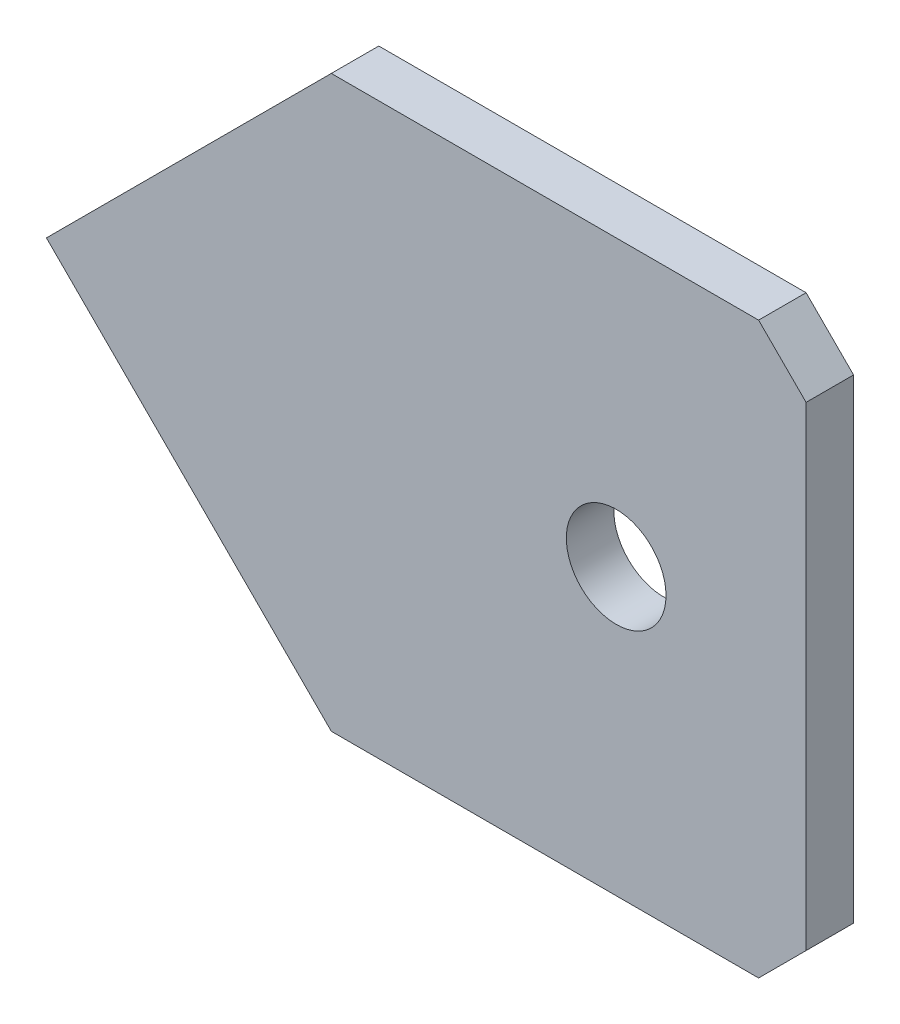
ISO-10303-21;
HEADER;
FILE_DESCRIPTION(('STEP AP214'),'2;1');
FILE_NAME('part.step','',(''),(''),'','','');
FILE_SCHEMA(('AUTOMOTIVE_DESIGN { 1 0 10303 214 1 1 1 1 }'));
ENDSEC;
DATA;
#1=APPLICATION_CONTEXT('core data for automotive mechanical design processes');
#2=APPLICATION_PROTOCOL_DEFINITION('international standard','automotive_design',2000,#1);
#3=PRODUCT_CONTEXT('',#1,'mechanical');
#4=PRODUCT('Part','Part','',(#3));
#5=PRODUCT_RELATED_PRODUCT_CATEGORY('part','',(#4));
#6=PRODUCT_DEFINITION_FORMATION('','',#4);
#7=PRODUCT_DEFINITION_CONTEXT('part definition',#1,'design');
#8=PRODUCT_DEFINITION('design','',#6,#7);
#9=PRODUCT_DEFINITION_SHAPE('','',#8);
#10=(LENGTH_UNIT() NAMED_UNIT(*) SI_UNIT(.MILLI.,.METRE.));
#11=(NAMED_UNIT(*) PLANE_ANGLE_UNIT() SI_UNIT($,.RADIAN.));
#12=(NAMED_UNIT(*) SI_UNIT($,.STERADIAN.) SOLID_ANGLE_UNIT());
#13=UNCERTAINTY_MEASURE_WITH_UNIT(LENGTH_MEASURE(1.E-05),#10,'distance_accuracy_value','');
#14=(GEOMETRIC_REPRESENTATION_CONTEXT(3) GLOBAL_UNCERTAINTY_ASSIGNED_CONTEXT((#13)) GLOBAL_UNIT_ASSIGNED_CONTEXT((#10,
#11,#12)) REPRESENTATION_CONTEXT('',''));
#15=CARTESIAN_POINT('',(0.,0.,0.));
#16=DIRECTION('',(0.,0.,1.));
#17=DIRECTION('',(1.,0.,0.));
#18=AXIS2_PLACEMENT_3D('',#15,#16,#17);
#19=CARTESIAN_POINT('',(-40.,-30.,5.));
#20=DIRECTION('',(0.,1.,0.));
#21=DIRECTION('',(0.,0.,1.));
#22=AXIS2_PLACEMENT_3D('',#19,#20,#21);
#23=PLANE('',#22);
#24=DIRECTION('',(1.,0.,0.));
#25=VECTOR('',#24,1.);
#26=CARTESIAN_POINT('',(-40.,-30.,0.));
#27=LINE('',#26,#25);
#28=CARTESIAN_POINT('',(-9.99999999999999,-30.,0.));
#29=VERTEX_POINT('',#28);
#30=CARTESIAN_POINT('',(35.,-30.,0.));
#31=VERTEX_POINT('',#30);
#32=EDGE_CURVE('E133',#29,#31,#27,.T.);
#33=ORIENTED_EDGE('',*,*,#32,.T.);
#34=DIRECTION('',(0.,0.,1.));
#35=VECTOR('',#34,1.);
#36=CARTESIAN_POINT('',(35.,-30.,5.));
#37=LINE('',#36,#35);
#38=CARTESIAN_POINT('',(35.,-30.,5.));
#39=VERTEX_POINT('',#38);
#40=EDGE_CURVE('E11',#31,#39,#37,.T.);
#41=ORIENTED_EDGE('',*,*,#40,.T.);
#42=DIRECTION('',(1.,0.,0.));
#43=VECTOR('',#42,1.);
#44=CARTESIAN_POINT('',(-40.,-30.,5.));
#45=LINE('',#44,#43);
#46=CARTESIAN_POINT('',(-9.99999999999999,-30.,5.00000000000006));
#47=VERTEX_POINT('',#46);
#48=EDGE_CURVE('E117',#47,#39,#45,.T.);
#49=ORIENTED_EDGE('',*,*,#48,.F.);
#50=DIRECTION('',(0.,0.,-1.));
#51=VECTOR('',#50,1.);
#52=CARTESIAN_POINT('',(-9.99999999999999,-30.,136.40615246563));
#53=LINE('',#52,#51);
#54=EDGE_CURVE('E101',#47,#29,#53,.T.);
#55=ORIENTED_EDGE('',*,*,#54,.T.);
#56=EDGE_LOOP('',(#33,#41,#49,#55));
#57=FACE_BOUND('',#56,.T.);
#58=ADVANCED_FACE('F43',(#57),#23,.F.);
#59=CARTESIAN_POINT('',(40.,30.,5.));
#60=DIRECTION('',(-1.,0.,0.));
#61=DIRECTION('',(0.,-1.,0.));
#62=AXIS2_PLACEMENT_3D('',#59,#60,#61);
#63=PLANE('',#62);
#64=DIRECTION('',(0.,1.,0.));
#65=VECTOR('',#64,1.);
#66=CARTESIAN_POINT('',(40.,30.,0.));
#67=LINE('',#66,#65);
#68=CARTESIAN_POINT('',(40.,-25.,0.));
#69=VERTEX_POINT('',#68);
#70=CARTESIAN_POINT('',(40.,25.,0.));
#71=VERTEX_POINT('',#70);
#72=EDGE_CURVE('E129',#69,#71,#67,.T.);
#73=ORIENTED_EDGE('',*,*,#72,.T.);
#74=DIRECTION('',(0.,0.,1.));
#75=VECTOR('',#74,1.);
#76=CARTESIAN_POINT('',(40.,25.,5.));
#77=LINE('',#76,#75);
#78=CARTESIAN_POINT('',(40.,25.,5.));
#79=VERTEX_POINT('',#78);
#80=EDGE_CURVE('E61',#71,#79,#77,.T.);
#81=ORIENTED_EDGE('',*,*,#80,.T.);
#82=DIRECTION('',(0.,1.,0.));
#83=VECTOR('',#82,1.);
#84=CARTESIAN_POINT('',(40.,30.,5.));
#85=LINE('',#84,#83);
#86=CARTESIAN_POINT('',(40.,-25.,5.));
#87=VERTEX_POINT('',#86);
#88=EDGE_CURVE('E124',#87,#79,#85,.T.);
#89=ORIENTED_EDGE('',*,*,#88,.F.);
#90=DIRECTION('',(0.,0.,-1.));
#91=VECTOR('',#90,1.);
#92=CARTESIAN_POINT('',(40.,-25.,5.));
#93=LINE('',#92,#91);
#94=EDGE_CURVE('E155',#87,#69,#93,.T.);
#95=ORIENTED_EDGE('',*,*,#94,.T.);
#96=EDGE_LOOP('',(#73,#81,#89,#95));
#97=FACE_BOUND('',#96,.T.);
#98=ADVANCED_FACE('F167',(#97),#63,.F.);
#99=CARTESIAN_POINT('',(-40.,30.,5.));
#100=DIRECTION('',(0.,-1.,0.));
#101=DIRECTION('',(0.,0.,-1.));
#102=AXIS2_PLACEMENT_3D('',#99,#100,#101);
#103=PLANE('',#102);
#104=DIRECTION('',(-1.,0.,0.));
#105=VECTOR('',#104,1.);
#106=CARTESIAN_POINT('',(-40.,30.,5.));
#107=LINE('',#106,#105);
#108=CARTESIAN_POINT('',(35.,30.,5.));
#109=VERTEX_POINT('',#108);
#110=CARTESIAN_POINT('',(-10.,30.,5.00000000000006));
#111=VERTEX_POINT('',#110);
#112=EDGE_CURVE('E127',#109,#111,#107,.T.);
#113=ORIENTED_EDGE('',*,*,#112,.F.);
#114=DIRECTION('',(0.,0.,-1.));
#115=VECTOR('',#114,1.);
#116=CARTESIAN_POINT('',(35.,30.,5.));
#117=LINE('',#116,#115);
#118=CARTESIAN_POINT('',(35.,30.,0.));
#119=VERTEX_POINT('',#118);
#120=EDGE_CURVE('E143',#109,#119,#117,.T.);
#121=ORIENTED_EDGE('',*,*,#120,.T.);
#122=DIRECTION('',(-1.,0.,0.));
#123=VECTOR('',#122,1.);
#124=CARTESIAN_POINT('',(-40.,30.,0.));
#125=LINE('',#124,#123);
#126=CARTESIAN_POINT('',(-10.,30.,0.));
#127=VERTEX_POINT('',#126);
#128=EDGE_CURVE('E121',#119,#127,#125,.T.);
#129=ORIENTED_EDGE('',*,*,#128,.T.);
#130=DIRECTION('',(0.,0.,-1.));
#131=VECTOR('',#130,1.);
#132=CARTESIAN_POINT('',(-10.,30.,136.40615246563));
#133=LINE('',#132,#131);
#134=EDGE_CURVE('E111',#111,#127,#133,.T.);
#135=ORIENTED_EDGE('',*,*,#134,.F.);
#136=EDGE_LOOP('',(#113,#121,#129,#135));
#137=FACE_BOUND('',#136,.T.);
#138=ADVANCED_FACE('F161',(#137),#103,.F.);
#139=CARTESIAN_POINT('',(-40.,-30.,5.));
#140=DIRECTION('',(0.,0.,1.));
#141=DIRECTION('',(1.,0.,0.));
#142=AXIS2_PLACEMENT_3D('',#139,#140,#141);
#143=PLANE('',#142);
#144=ORIENTED_EDGE('',*,*,#88,.T.);
#145=DIRECTION('',(0.707106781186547,-0.707106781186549,0.));
#146=VECTOR('',#145,1.);
#147=CARTESIAN_POINT('',(27.5000000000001,37.4999999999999,5.));
#148=LINE('',#147,#146);
#149=EDGE_CURVE('E51',#79,#109,#148,.F.);
#150=ORIENTED_EDGE('',*,*,#149,.T.);
#151=ORIENTED_EDGE('',*,*,#112,.T.);
#152=DIRECTION('',(0.707106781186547,0.707106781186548,0.));
#153=VECTOR('',#152,1.);
#154=CARTESIAN_POINT('',(-55.,-15.,5.));
#155=LINE('',#154,#153);
#156=CARTESIAN_POINT('',(-40.,0.,5.00000000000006));
#157=VERTEX_POINT('',#156);
#158=EDGE_CURVE('E122',#157,#111,#155,.T.);
#159=ORIENTED_EDGE('',*,*,#158,.F.);
#160=DIRECTION('',(-0.707106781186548,0.707106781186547,0.));
#161=VECTOR('',#160,1.);
#162=CARTESIAN_POINT('',(-25.,-15.,5.));
#163=LINE('',#162,#161);
#164=EDGE_CURVE('E106',#47,#157,#163,.T.);
#165=ORIENTED_EDGE('',*,*,#164,.F.);
#166=ORIENTED_EDGE('',*,*,#48,.T.);
#167=DIRECTION('',(-0.707106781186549,-0.707106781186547,0.));
#168=VECTOR('',#167,1.);
#169=CARTESIAN_POINT('',(-2.50000000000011,-67.5,5.));
#170=LINE('',#169,#168);
#171=EDGE_CURVE('E156',#39,#87,#170,.F.);
#172=ORIENTED_EDGE('',*,*,#171,.T.);
#173=EDGE_LOOP('',(#144,#150,#151,#159,#165,#166,#172));
#174=FACE_BOUND('',#173,.T.);
#175=CARTESIAN_POINT('',(20.,0.,5.));
#176=DIRECTION('',(0.,0.,1.));
#177=DIRECTION('',(1.,0.,0.));
#178=AXIS2_PLACEMENT_3D('',#175,#176,#177);
#179=CIRCLE('',#178,5.25);
#180=CARTESIAN_POINT('',(25.25,0.,5.));
#181=VERTEX_POINT('',#180);
#182=EDGE_CURVE('E132',#181,#181,#179,.T.);
#183=ORIENTED_EDGE('',*,*,#182,.F.);
#184=EDGE_LOOP('',(#183));
#185=FACE_BOUND('',#184,.T.);
#186=ADVANCED_FACE('F116',(#174,#185),#143,.T.);
#187=CARTESIAN_POINT('',(-40.,-30.,0.));
#188=DIRECTION('',(0.,0.,1.));
#189=DIRECTION('',(1.,0.,0.));
#190=AXIS2_PLACEMENT_3D('',#187,#188,#189);
#191=PLANE('',#190);
#192=CARTESIAN_POINT('',(20.,0.,0.));
#193=DIRECTION('',(0.,0.,1.));
#194=DIRECTION('',(1.,0.,0.));
#195=AXIS2_PLACEMENT_3D('',#192,#193,#194);
#196=CIRCLE('',#195,5.25);
#197=CARTESIAN_POINT('',(25.25,0.,0.));
#198=VERTEX_POINT('',#197);
#199=EDGE_CURVE('E140',#198,#198,#196,.T.);
#200=ORIENTED_EDGE('',*,*,#199,.T.);
#201=EDGE_LOOP('',(#200));
#202=FACE_BOUND('',#201,.T.);
#203=ORIENTED_EDGE('',*,*,#128,.F.);
#204=DIRECTION('',(-0.707106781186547,0.707106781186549,0.));
#205=VECTOR('',#204,1.);
#206=CARTESIAN_POINT('',(35.,30.,0.));
#207=LINE('',#206,#205);
#208=EDGE_CURVE('E148',#119,#71,#207,.F.);
#209=ORIENTED_EDGE('',*,*,#208,.T.);
#210=ORIENTED_EDGE('',*,*,#72,.F.);
#211=DIRECTION('',(0.707106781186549,0.707106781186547,0.));
#212=VECTOR('',#211,1.);
#213=CARTESIAN_POINT('',(40.,-25.,0.));
#214=LINE('',#213,#212);
#215=EDGE_CURVE('E149',#69,#31,#214,.F.);
#216=ORIENTED_EDGE('',*,*,#215,.T.);
#217=ORIENTED_EDGE('',*,*,#32,.F.);
#218=DIRECTION('',(-0.707106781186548,0.707106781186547,0.));
#219=VECTOR('',#218,1.);
#220=CARTESIAN_POINT('',(-25.,-15.,0.));
#221=LINE('',#220,#219);
#222=CARTESIAN_POINT('',(-40.,0.,0.));
#223=VERTEX_POINT('',#222);
#224=EDGE_CURVE('E107',#29,#223,#221,.T.);
#225=ORIENTED_EDGE('',*,*,#224,.T.);
#226=DIRECTION('',(0.707106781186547,0.707106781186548,0.));
#227=VECTOR('',#226,1.);
#228=CARTESIAN_POINT('',(-55.,-15.,0.));
#229=LINE('',#228,#227);
#230=EDGE_CURVE('E145',#223,#127,#229,.T.);
#231=ORIENTED_EDGE('',*,*,#230,.T.);
#232=EDGE_LOOP('',(#203,#209,#210,#216,#217,#225,#231));
#233=FACE_BOUND('',#232,.T.);
#234=ADVANCED_FACE('F169',(#202,#233),#191,.F.);
#235=CARTESIAN_POINT('',(20.,0.,5.));
#236=DIRECTION('',(0.,0.,1.));
#237=DIRECTION('',(1.,0.,0.));
#238=AXIS2_PLACEMENT_3D('',#235,#236,#237);
#239=CYLINDRICAL_SURFACE('',#238,5.25);
#240=ORIENTED_EDGE('',*,*,#182,.T.);
#241=EDGE_LOOP('',(#240));
#242=FACE_BOUND('',#241,.T.);
#243=ORIENTED_EDGE('',*,*,#199,.F.);
#244=EDGE_LOOP('',(#243));
#245=FACE_BOUND('',#244,.T.);
#246=ADVANCED_FACE('F181',(#242,#245),#239,.F.);
#247=CARTESIAN_POINT('',(-10.,30.,136.40615246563));
#248=DIRECTION('',(0.707106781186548,-0.707106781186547,0.));
#249=DIRECTION('',(0.707106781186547,0.707106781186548,0.));
#250=AXIS2_PLACEMENT_3D('',#247,#248,#249);
#251=PLANE('',#250);
#252=DIRECTION('',(0.,0.,-1.));
#253=VECTOR('',#252,1.);
#254=CARTESIAN_POINT('',(-40.,0.,136.40615246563));
#255=LINE('',#254,#253);
#256=EDGE_CURVE('E115',#157,#223,#255,.T.);
#257=ORIENTED_EDGE('',*,*,#256,.F.);
#258=ORIENTED_EDGE('',*,*,#158,.T.);
#259=ORIENTED_EDGE('',*,*,#134,.T.);
#260=ORIENTED_EDGE('',*,*,#230,.F.);
#261=EDGE_LOOP('',(#257,#258,#259,#260));
#262=FACE_BOUND('',#261,.T.);
#263=ADVANCED_FACE('F174',(#262),#251,.F.);
#264=CARTESIAN_POINT('',(-40.,0.,136.40615246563));
#265=DIRECTION('',(0.707106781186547,0.707106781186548,0.));
#266=DIRECTION('',(-0.707106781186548,0.707106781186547,0.));
#267=AXIS2_PLACEMENT_3D('',#264,#265,#266);
#268=PLANE('',#267);
#269=ORIENTED_EDGE('',*,*,#54,.F.);
#270=ORIENTED_EDGE('',*,*,#164,.T.);
#271=ORIENTED_EDGE('',*,*,#256,.T.);
#272=ORIENTED_EDGE('',*,*,#224,.F.);
#273=EDGE_LOOP('',(#269,#270,#271,#272));
#274=FACE_BOUND('',#273,.T.);
#275=ADVANCED_FACE('F102',(#274),#268,.F.);
#276=CARTESIAN_POINT('',(35.,30.,5.));
#277=DIRECTION('',(-0.707106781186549,-0.707106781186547,0.));
#278=DIRECTION('',(0.707106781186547,-0.707106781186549,0.));
#279=AXIS2_PLACEMENT_3D('',#276,#277,#278);
#280=PLANE('',#279);
#281=ORIENTED_EDGE('',*,*,#149,.F.);
#282=ORIENTED_EDGE('',*,*,#80,.F.);
#283=ORIENTED_EDGE('',*,*,#208,.F.);
#284=ORIENTED_EDGE('',*,*,#120,.F.);
#285=EDGE_LOOP('',(#281,#282,#283,#284));
#286=FACE_BOUND('',#285,.T.);
#287=ADVANCED_FACE('F168',(#286),#280,.F.);
#288=CARTESIAN_POINT('',(40.,-25.,5.));
#289=DIRECTION('',(-0.707106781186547,0.707106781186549,0.));
#290=DIRECTION('',(-0.707106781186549,-0.707106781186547,0.));
#291=AXIS2_PLACEMENT_3D('',#288,#289,#290);
#292=PLANE('',#291);
#293=ORIENTED_EDGE('',*,*,#171,.F.);
#294=ORIENTED_EDGE('',*,*,#40,.F.);
#295=ORIENTED_EDGE('',*,*,#215,.F.);
#296=ORIENTED_EDGE('',*,*,#94,.F.);
#297=EDGE_LOOP('',(#293,#294,#295,#296));
#298=FACE_BOUND('',#297,.T.);
#299=ADVANCED_FACE('F44',(#298),#292,.F.);
#300=CLOSED_SHELL('',(#58,#98,#138,#186,#234,#246,#263,#275,#287,#299));
#301=MANIFOLD_SOLID_BREP('B2',#300);
#302=ADVANCED_BREP_SHAPE_REPRESENTATION('',(#18,#301),#14);
#303=SHAPE_DEFINITION_REPRESENTATION(#9,#302);
ENDSEC;
END-ISO-10303-21;
